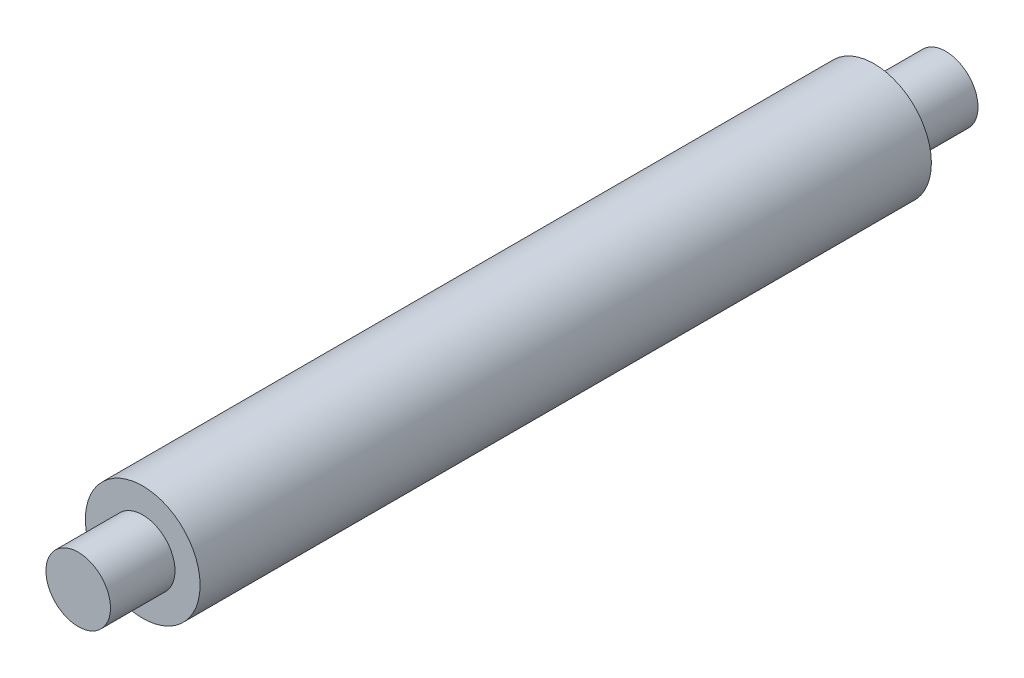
ISO-10303-21;
HEADER;
FILE_DESCRIPTION(('STEP AP214'),'2;1');
FILE_NAME('part.step','',(''),(''),'','','');
FILE_SCHEMA(('AUTOMOTIVE_DESIGN { 1 0 10303 214 1 1 1 1 }'));
ENDSEC;
DATA;
#1=APPLICATION_CONTEXT('core data for automotive mechanical design processes');
#2=APPLICATION_PROTOCOL_DEFINITION('international standard','automotive_design',2000,#1);
#3=PRODUCT_CONTEXT('',#1,'mechanical');
#4=PRODUCT('Part','Part','',(#3));
#5=PRODUCT_RELATED_PRODUCT_CATEGORY('part','',(#4));
#6=PRODUCT_DEFINITION_FORMATION('','',#4);
#7=PRODUCT_DEFINITION_CONTEXT('part definition',#1,'design');
#8=PRODUCT_DEFINITION('design','',#6,#7);
#9=PRODUCT_DEFINITION_SHAPE('','',#8);
#10=(LENGTH_UNIT() NAMED_UNIT(*) SI_UNIT(.MILLI.,.METRE.));
#11=(NAMED_UNIT(*) PLANE_ANGLE_UNIT() SI_UNIT($,.RADIAN.));
#12=(NAMED_UNIT(*) SI_UNIT($,.STERADIAN.) SOLID_ANGLE_UNIT());
#13=UNCERTAINTY_MEASURE_WITH_UNIT(LENGTH_MEASURE(1.E-05),#10,'distance_accuracy_value','');
#14=(GEOMETRIC_REPRESENTATION_CONTEXT(3) GLOBAL_UNCERTAINTY_ASSIGNED_CONTEXT((#13)) GLOBAL_UNIT_ASSIGNED_CONTEXT((#10,
#11,#12)) REPRESENTATION_CONTEXT('',''));
#15=CARTESIAN_POINT('',(0.,0.,0.));
#16=DIRECTION('',(0.,0.,1.));
#17=DIRECTION('',(1.,0.,0.));
#18=AXIS2_PLACEMENT_3D('',#15,#16,#17);
#19=CARTESIAN_POINT('',(0.,0.,102.));
#20=DIRECTION('',(0.,0.,-1.));
#21=DIRECTION('',(-1.,0.,0.));
#22=AXIS2_PLACEMENT_3D('',#19,#20,#21);
#23=CYLINDRICAL_SURFACE('',#22,8.);
#24=CARTESIAN_POINT('',(0.,0.,102.));
#25=DIRECTION('',(0.,0.,1.));
#26=DIRECTION('',(1.,0.,0.));
#27=AXIS2_PLACEMENT_3D('',#24,#25,#26);
#28=CIRCLE('',#27,8.);
#29=CARTESIAN_POINT('',(8.,0.,102.));
#30=VERTEX_POINT('',#29);
#31=EDGE_CURVE('E42',#30,#30,#28,.T.);
#32=ORIENTED_EDGE('',*,*,#31,.F.);
#33=EDGE_LOOP('',(#32));
#34=FACE_BOUND('',#33,.T.);
#35=CARTESIAN_POINT('',(0.,0.,0.));
#36=DIRECTION('',(0.,0.,1.));
#37=DIRECTION('',(1.,0.,0.));
#38=AXIS2_PLACEMENT_3D('',#35,#36,#37);
#39=CIRCLE('',#38,8.);
#40=CARTESIAN_POINT('',(8.,0.,0.));
#41=VERTEX_POINT('',#40);
#42=EDGE_CURVE('E47',#41,#41,#39,.T.);
#43=ORIENTED_EDGE('',*,*,#42,.T.);
#44=EDGE_LOOP('',(#43));
#45=FACE_BOUND('',#44,.T.);
#46=ADVANCED_FACE('F35',(#34,#45),#23,.T.);
#47=CARTESIAN_POINT('',(0.,0.,102.));
#48=DIRECTION('',(0.,0.,1.));
#49=DIRECTION('',(1.,0.,0.));
#50=AXIS2_PLACEMENT_3D('',#47,#48,#49);
#51=PLANE('',#50);
#52=CARTESIAN_POINT('',(0.,0.,102.));
#53=DIRECTION('',(0.,0.,1.));
#54=DIRECTION('',(1.,0.,0.));
#55=AXIS2_PLACEMENT_3D('',#52,#53,#54);
#56=CIRCLE('',#55,4.5);
#57=CARTESIAN_POINT('',(4.5,0.,102.));
#58=VERTEX_POINT('',#57);
#59=EDGE_CURVE('E10',#58,#58,#56,.T.);
#60=ORIENTED_EDGE('',*,*,#59,.F.);
#61=EDGE_LOOP('',(#60));
#62=FACE_BOUND('',#61,.T.);
#63=ORIENTED_EDGE('',*,*,#31,.T.);
#64=EDGE_LOOP('',(#63));
#65=FACE_BOUND('',#64,.T.);
#66=ADVANCED_FACE('F80',(#62,#65),#51,.T.);
#67=CARTESIAN_POINT('',(0.,0.,0.));
#68=DIRECTION('',(0.,0.,1.));
#69=DIRECTION('',(1.,0.,0.));
#70=AXIS2_PLACEMENT_3D('',#67,#68,#69);
#71=PLANE('',#70);
#72=CARTESIAN_POINT('',(0.,0.,0.));
#73=DIRECTION('',(0.,0.,1.));
#74=DIRECTION('',(1.,0.,0.));
#75=AXIS2_PLACEMENT_3D('',#72,#73,#74);
#76=CIRCLE('',#75,4.5);
#77=CARTESIAN_POINT('',(4.5,0.,0.));
#78=VERTEX_POINT('',#77);
#79=EDGE_CURVE('E38',#78,#78,#76,.T.);
#80=ORIENTED_EDGE('',*,*,#79,.T.);
#81=EDGE_LOOP('',(#80));
#82=FACE_BOUND('',#81,.T.);
#83=ORIENTED_EDGE('',*,*,#42,.F.);
#84=EDGE_LOOP('',(#83));
#85=FACE_BOUND('',#84,.T.);
#86=ADVANCED_FACE('F85',(#82,#85),#71,.F.);
#87=CARTESIAN_POINT('',(0.,0.,-9.99999999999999));
#88=DIRECTION('',(0.,0.,1.));
#89=DIRECTION('',(1.,0.,0.));
#90=AXIS2_PLACEMENT_3D('',#87,#88,#89);
#91=PLANE('',#90);
#92=CARTESIAN_POINT('',(0.,0.,-9.99999999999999));
#93=DIRECTION('',(0.,0.,1.));
#94=DIRECTION('',(1.,0.,0.));
#95=AXIS2_PLACEMENT_3D('',#92,#93,#94);
#96=CIRCLE('',#95,4.5);
#97=CARTESIAN_POINT('',(4.5,0.,-9.99999999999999));
#98=VERTEX_POINT('',#97);
#99=EDGE_CURVE('E50',#98,#98,#96,.T.);
#100=ORIENTED_EDGE('',*,*,#99,.F.);
#101=EDGE_LOOP('',(#100));
#102=FACE_BOUND('',#101,.T.);
#103=ADVANCED_FACE('F76',(#102),#91,.F.);
#104=CARTESIAN_POINT('',(0.,0.,-9.99999999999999));
#105=DIRECTION('',(0.,0.,1.));
#106=DIRECTION('',(1.,0.,0.));
#107=AXIS2_PLACEMENT_3D('',#104,#105,#106);
#108=CYLINDRICAL_SURFACE('',#107,4.5);
#109=ORIENTED_EDGE('',*,*,#99,.T.);
#110=EDGE_LOOP('',(#109));
#111=FACE_BOUND('',#110,.T.);
#112=ORIENTED_EDGE('',*,*,#79,.F.);
#113=EDGE_LOOP('',(#112));
#114=FACE_BOUND('',#113,.T.);
#115=ADVANCED_FACE('F69',(#111,#114),#108,.T.);
#116=ORIENTED_EDGE('',*,*,#59,.T.);
#117=EDGE_LOOP('',(#116));
#118=FACE_BOUND('',#117,.T.);
#119=CARTESIAN_POINT('',(0.,0.,111.));
#120=DIRECTION('',(0.,0.,1.));
#121=DIRECTION('',(1.,0.,0.));
#122=AXIS2_PLACEMENT_3D('',#119,#120,#121);
#123=CIRCLE('',#122,4.5);
#124=CARTESIAN_POINT('',(4.5,0.,111.));
#125=VERTEX_POINT('',#124);
#126=EDGE_CURVE('E59',#125,#125,#123,.T.);
#127=ORIENTED_EDGE('',*,*,#126,.F.);
#128=EDGE_LOOP('',(#127));
#129=FACE_BOUND('',#128,.T.);
#130=ADVANCED_FACE('F67',(#118,#129),#108,.T.);
#131=CARTESIAN_POINT('',(0.,0.,111.));
#132=DIRECTION('',(0.,0.,1.));
#133=DIRECTION('',(1.,0.,0.));
#134=AXIS2_PLACEMENT_3D('',#131,#132,#133);
#135=PLANE('',#134);
#136=ORIENTED_EDGE('',*,*,#126,.T.);
#137=EDGE_LOOP('',(#136));
#138=FACE_BOUND('',#137,.T.);
#139=ADVANCED_FACE('F65',(#138),#135,.T.);
#140=CLOSED_SHELL('',(#46,#66,#86,#103,#115,#130,#139));
#141=MANIFOLD_SOLID_BREP('B2',#140);
#142=ADVANCED_BREP_SHAPE_REPRESENTATION('',(#18,#141),#14);
#143=SHAPE_DEFINITION_REPRESENTATION(#9,#142);
ENDSEC;
END-ISO-10303-21;
